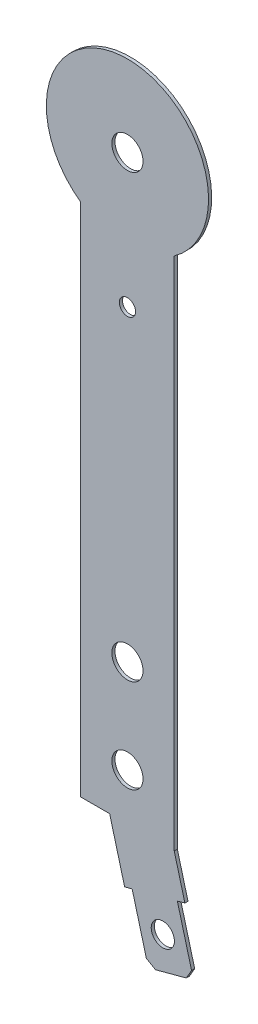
ISO-10303-21;
HEADER;
FILE_DESCRIPTION(('STEP AP214'),'2;1');
FILE_NAME('part.step','',(''),(''),'','','');
FILE_SCHEMA(('AUTOMOTIVE_DESIGN { 1 0 10303 214 1 1 1 1 }'));
ENDSEC;
DATA;
#1=APPLICATION_CONTEXT('core data for automotive mechanical design processes');
#2=APPLICATION_PROTOCOL_DEFINITION('international standard','automotive_design',2000,#1);
#3=PRODUCT_CONTEXT('',#1,'mechanical');
#4=PRODUCT('Part','Part','',(#3));
#5=PRODUCT_RELATED_PRODUCT_CATEGORY('part','',(#4));
#6=PRODUCT_DEFINITION_FORMATION('','',#4);
#7=PRODUCT_DEFINITION_CONTEXT('part definition',#1,'design');
#8=PRODUCT_DEFINITION('design','',#6,#7);
#9=PRODUCT_DEFINITION_SHAPE('','',#8);
#10=(LENGTH_UNIT() NAMED_UNIT(*) SI_UNIT(.MILLI.,.METRE.));
#11=(NAMED_UNIT(*) PLANE_ANGLE_UNIT() SI_UNIT($,.RADIAN.));
#12=(NAMED_UNIT(*) SI_UNIT($,.STERADIAN.) SOLID_ANGLE_UNIT());
#13=UNCERTAINTY_MEASURE_WITH_UNIT(LENGTH_MEASURE(1.E-05),#10,'distance_accuracy_value','');
#14=(GEOMETRIC_REPRESENTATION_CONTEXT(3) GLOBAL_UNCERTAINTY_ASSIGNED_CONTEXT((#13)) GLOBAL_UNIT_ASSIGNED_CONTEXT((#10,
#11,#12)) REPRESENTATION_CONTEXT('',''));
#15=CARTESIAN_POINT('',(0.,0.,0.));
#16=DIRECTION('',(0.,0.,1.));
#17=DIRECTION('',(1.,0.,0.));
#18=AXIS2_PLACEMENT_3D('',#15,#16,#17);
#19=CARTESIAN_POINT('',(0.,59.1936714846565,0.3175));
#20=DIRECTION('',(0.,0.,-1.));
#21=DIRECTION('',(-1.,0.,0.));
#22=AXIS2_PLACEMENT_3D('',#19,#20,#21);
#23=CYLINDRICAL_SURFACE('',#22,8.255);
#24=CARTESIAN_POINT('',(0.,59.1936714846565,0.));
#25=DIRECTION('',(0.,0.,1.));
#26=DIRECTION('',(1.,0.,0.));
#27=AXIS2_PLACEMENT_3D('',#24,#25,#26);
#28=CIRCLE('',#27,8.255);
#29=CARTESIAN_POINT('',(4.7625,52.451,0.));
#30=VERTEX_POINT('',#29);
#31=CARTESIAN_POINT('',(-4.7625,52.451,0.));
#32=VERTEX_POINT('',#31);
#33=EDGE_CURVE('E197',#30,#32,#28,.T.);
#34=ORIENTED_EDGE('',*,*,#33,.T.);
#35=DIRECTION('',(0.,0.,-1.));
#36=VECTOR('',#35,1.);
#37=CARTESIAN_POINT('',(-4.7625,52.451,0.3175));
#38=LINE('',#37,#36);
#39=CARTESIAN_POINT('',(-4.7625,52.451,0.3175));
#40=VERTEX_POINT('',#39);
#41=EDGE_CURVE('E220',#40,#32,#38,.T.);
#42=ORIENTED_EDGE('',*,*,#41,.F.);
#43=CARTESIAN_POINT('',(0.,59.1936714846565,0.3175));
#44=DIRECTION('',(0.,0.,1.));
#45=DIRECTION('',(1.,0.,0.));
#46=AXIS2_PLACEMENT_3D('',#43,#44,#45);
#47=CIRCLE('',#46,8.255);
#48=CARTESIAN_POINT('',(4.7625,52.451,0.3175));
#49=VERTEX_POINT('',#48);
#50=EDGE_CURVE('E200',#49,#40,#47,.T.);
#51=ORIENTED_EDGE('',*,*,#50,.F.);
#52=DIRECTION('',(0.,0.,-1.));
#53=VECTOR('',#52,1.);
#54=CARTESIAN_POINT('',(4.7625,52.451,0.3175));
#55=LINE('',#54,#53);
#56=EDGE_CURVE('E209',#49,#30,#55,.T.);
#57=ORIENTED_EDGE('',*,*,#56,.T.);
#58=EDGE_LOOP('',(#34,#42,#51,#57));
#59=FACE_BOUND('',#58,.T.);
#60=ADVANCED_FACE('F35',(#59),#23,.T.);
#61=CARTESIAN_POINT('',(-4.7625,52.451,0.3175));
#62=DIRECTION('',(1.,0.,0.));
#63=DIRECTION('',(0.,1.,0.));
#64=AXIS2_PLACEMENT_3D('',#61,#62,#63);
#65=PLANE('',#64);
#66=DIRECTION('',(0.,-1.,0.));
#67=VECTOR('',#66,1.);
#68=CARTESIAN_POINT('',(-4.7625,52.451,0.));
#69=LINE('',#68,#67);
#70=CARTESIAN_POINT('',(-4.76250000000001,0.,0.));
#71=VERTEX_POINT('',#70);
#72=EDGE_CURVE('E212',#32,#71,#69,.T.);
#73=ORIENTED_EDGE('',*,*,#72,.T.);
#74=DIRECTION('',(0.,0.,-1.));
#75=VECTOR('',#74,1.);
#76=CARTESIAN_POINT('',(-4.76250000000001,0.,0.3175));
#77=LINE('',#76,#75);
#78=CARTESIAN_POINT('',(-4.76250000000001,0.,0.3175));
#79=VERTEX_POINT('',#78);
#80=EDGE_CURVE('E224',#79,#71,#77,.T.);
#81=ORIENTED_EDGE('',*,*,#80,.F.);
#82=DIRECTION('',(0.,-1.,0.));
#83=VECTOR('',#82,1.);
#84=CARTESIAN_POINT('',(-4.7625,52.451,0.3175));
#85=LINE('',#84,#83);
#86=EDGE_CURVE('E203',#40,#79,#85,.T.);
#87=ORIENTED_EDGE('',*,*,#86,.F.);
#88=ORIENTED_EDGE('',*,*,#41,.T.);
#89=EDGE_LOOP('',(#73,#81,#87,#88));
#90=FACE_BOUND('',#89,.T.);
#91=ADVANCED_FACE('F243',(#90),#65,.F.);
#92=CARTESIAN_POINT('',(-4.76250000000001,0.,0.3175));
#93=DIRECTION('',(0.,1.,0.));
#94=DIRECTION('',(0.,0.,1.));
#95=AXIS2_PLACEMENT_3D('',#92,#93,#94);
#96=PLANE('',#95);
#97=DIRECTION('',(1.,0.,0.));
#98=VECTOR('',#97,1.);
#99=CARTESIAN_POINT('',(-4.76250000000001,0.,0.));
#100=LINE('',#99,#98);
#101=CARTESIAN_POINT('',(-1.81150374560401,0.,0.));
#102=VERTEX_POINT('',#101);
#103=EDGE_CURVE('E214',#71,#102,#100,.T.);
#104=ORIENTED_EDGE('',*,*,#103,.T.);
#105=DIRECTION('',(0.,0.,1.));
#106=VECTOR('',#105,1.);
#107=CARTESIAN_POINT('',(-1.81150374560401,0.,-14.4179313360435));
#108=LINE('',#107,#106);
#109=CARTESIAN_POINT('',(-1.81150374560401,0.,0.3175));
#110=VERTEX_POINT('',#109);
#111=EDGE_CURVE('E144',#102,#110,#108,.T.);
#112=ORIENTED_EDGE('',*,*,#111,.T.);
#113=DIRECTION('',(1.,0.,0.));
#114=VECTOR('',#113,1.);
#115=CARTESIAN_POINT('',(-4.76250000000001,0.,0.3175));
#116=LINE('',#115,#114);
#117=EDGE_CURVE('E158',#79,#110,#116,.T.);
#118=ORIENTED_EDGE('',*,*,#117,.F.);
#119=ORIENTED_EDGE('',*,*,#80,.T.);
#120=EDGE_LOOP('',(#104,#112,#118,#119));
#121=FACE_BOUND('',#120,.T.);
#122=ADVANCED_FACE('F345',(#121),#96,.F.);
#123=CARTESIAN_POINT('',(4.7625,52.451,0.3175));
#124=DIRECTION('',(-1.,0.,0.));
#125=DIRECTION('',(0.,-1.,0.));
#126=AXIS2_PLACEMENT_3D('',#123,#124,#125);
#127=PLANE('',#126);
#128=DIRECTION('',(0.,1.,0.));
#129=VECTOR('',#128,1.);
#130=CARTESIAN_POINT('',(4.7625,52.451,0.));
#131=LINE('',#130,#129);
#132=CARTESIAN_POINT('',(4.76250000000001,0.,0.));
#133=VERTEX_POINT('',#132);
#134=EDGE_CURVE('E204',#133,#30,#131,.T.);
#135=ORIENTED_EDGE('',*,*,#134,.T.);
#136=ORIENTED_EDGE('',*,*,#56,.F.);
#137=DIRECTION('',(0.,1.,0.));
#138=VECTOR('',#137,1.);
#139=CARTESIAN_POINT('',(4.7625,52.451,0.3175));
#140=LINE('',#139,#138);
#141=CARTESIAN_POINT('',(4.76250000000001,0.,0.3175));
#142=VERTEX_POINT('',#141);
#143=EDGE_CURVE('E207',#142,#49,#140,.T.);
#144=ORIENTED_EDGE('',*,*,#143,.F.);
#145=DIRECTION('',(0.,0.,-1.));
#146=VECTOR('',#145,1.);
#147=CARTESIAN_POINT('',(4.76250000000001,0.,0.3175));
#148=LINE('',#147,#146);
#149=EDGE_CURVE('E227',#142,#133,#148,.T.);
#150=ORIENTED_EDGE('',*,*,#149,.T.);
#151=EDGE_LOOP('',(#135,#136,#144,#150));
#152=FACE_BOUND('',#151,.T.);
#153=ADVANCED_FACE('F247',(#152),#127,.F.);
#154=CARTESIAN_POINT('',(0.,59.1936714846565,0.3175));
#155=DIRECTION('',(0.,0.,1.));
#156=DIRECTION('',(1.,0.,0.));
#157=AXIS2_PLACEMENT_3D('',#154,#155,#156);
#158=PLANE('',#157);
#159=CARTESIAN_POINT('',(3.60214658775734,-7.93676010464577,0.3175));
#160=DIRECTION('',(0.,0.,1.));
#161=DIRECTION('',(1.,0.,0.));
#162=AXIS2_PLACEMENT_3D('',#159,#160,#161);
#163=CIRCLE('',#162,1.1811);
#164=CARTESIAN_POINT('',(4.78324658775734,-7.93676010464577,0.3175));
#165=VERTEX_POINT('',#164);
#166=EDGE_CURVE('E161',#165,#165,#163,.T.);
#167=ORIENTED_EDGE('',*,*,#166,.F.);
#168=EDGE_LOOP('',(#167));
#169=FACE_BOUND('',#168,.T.);
#170=CARTESIAN_POINT('',(0.,45.5676,0.3175));
#171=DIRECTION('',(0.,0.,1.));
#172=DIRECTION('',(1.,0.,0.));
#173=AXIS2_PLACEMENT_3D('',#170,#171,#172);
#174=CIRCLE('',#173,0.825499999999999);
#175=CARTESIAN_POINT('',(0.825499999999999,45.5676,0.3175));
#176=VERTEX_POINT('',#175);
#177=EDGE_CURVE('E179',#176,#176,#174,.T.);
#178=ORIENTED_EDGE('',*,*,#177,.F.);
#179=EDGE_LOOP('',(#178));
#180=FACE_BOUND('',#179,.T.);
#181=CARTESIAN_POINT('',(0.,14.2875,0.3175));
#182=DIRECTION('',(0.,0.,1.));
#183=DIRECTION('',(1.,0.,0.));
#184=AXIS2_PLACEMENT_3D('',#181,#182,#183);
#185=CIRCLE('',#184,1.5875);
#186=CARTESIAN_POINT('',(1.5875,14.2875,0.3175));
#187=VERTEX_POINT('',#186);
#188=EDGE_CURVE('E178',#187,#187,#185,.T.);
#189=ORIENTED_EDGE('',*,*,#188,.F.);
#190=EDGE_LOOP('',(#189));
#191=FACE_BOUND('',#190,.T.);
#192=CARTESIAN_POINT('',(0.,4.7625,0.3175));
#193=DIRECTION('',(0.,0.,1.));
#194=DIRECTION('',(1.,0.,0.));
#195=AXIS2_PLACEMENT_3D('',#192,#193,#194);
#196=CIRCLE('',#195,1.5875);
#197=CARTESIAN_POINT('',(1.5875,4.7625,0.3175));
#198=VERTEX_POINT('',#197);
#199=EDGE_CURVE('E185',#198,#198,#196,.T.);
#200=ORIENTED_EDGE('',*,*,#199,.F.);
#201=EDGE_LOOP('',(#200));
#202=FACE_BOUND('',#201,.T.);
#203=CARTESIAN_POINT('',(0.,59.1936714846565,0.3175));
#204=DIRECTION('',(0.,0.,1.));
#205=DIRECTION('',(1.,0.,0.));
#206=AXIS2_PLACEMENT_3D('',#203,#204,#205);
#207=CIRCLE('',#206,1.5875);
#208=CARTESIAN_POINT('',(1.5875,59.1936714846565,0.3175));
#209=VERTEX_POINT('',#208);
#210=EDGE_CURVE('E191',#209,#209,#207,.T.);
#211=ORIENTED_EDGE('',*,*,#210,.F.);
#212=EDGE_LOOP('',(#211));
#213=FACE_BOUND('',#212,.T.);
#214=DIRECTION('',(0.258819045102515,-0.96592582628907,0.));
#215=VECTOR('',#214,1.);
#216=CARTESIAN_POINT('',(2.12378618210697,-11.6198874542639,0.3175));
#217=LINE('',#216,#215);
#218=CARTESIAN_POINT('',(0.480285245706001,-5.48625845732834,0.3175));
#219=VERTEX_POINT('',#218);
#220=CARTESIAN_POINT('',(1.92656606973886,-10.8838519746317,0.3175));
#221=VERTEX_POINT('',#220);
#222=EDGE_CURVE('E153',#219,#221,#217,.T.);
#223=ORIENTED_EDGE('',*,*,#222,.T.);
#224=DIRECTION('',(-0.866025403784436,0.500000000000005,0.));
#225=VECTOR('',#224,1.);
#226=CARTESIAN_POINT('',(-29.8628162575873,7.46975646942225,0.3175));
#227=LINE('',#226,#225);
#228=CARTESIAN_POINT('',(2.85982166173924,-11.4226673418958,0.3175));
#229=VERTEX_POINT('',#228);
#230=EDGE_CURVE('E282',#221,#229,#227,.F.);
#231=ORIENTED_EDGE('',*,*,#230,.T.);
#232=DIRECTION('',(0.96592582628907,0.258819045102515,0.));
#233=VECTOR('',#232,1.);
#234=CARTESIAN_POINT('',(2.12378618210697,-11.6198874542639,0.3175));
#235=LINE('',#234,#233);
#236=CARTESIAN_POINT('',(5.9879724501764,-10.5844818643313,0.3175));
#237=VERTEX_POINT('',#236);
#238=EDGE_CURVE('E261',#229,#237,#235,.T.);
#239=ORIENTED_EDGE('',*,*,#238,.T.);
#240=DIRECTION('',(-0.500000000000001,-0.866025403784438,0.));
#241=VECTOR('',#240,1.);
#242=CARTESIAN_POINT('',(34.7058060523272,39.1562650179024,0.3175));
#243=LINE('',#242,#241);
#244=CARTESIAN_POINT('',(6.52678781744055,-9.65122627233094,0.3175));
#245=VERTEX_POINT('',#244);
#246=EDGE_CURVE('E278',#237,#245,#243,.F.);
#247=ORIENTED_EDGE('',*,*,#246,.T.);
#248=DIRECTION('',(-0.258819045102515,0.96592582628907,0.));
#249=VECTOR('',#248,1.);
#250=CARTESIAN_POINT('',(6.72400792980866,-10.3872617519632,0.3175));
#251=LINE('',#250,#249);
#252=CARTESIAN_POINT('',(5.0805069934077,-4.25363275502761,0.3175));
#253=VERTEX_POINT('',#252);
#254=EDGE_CURVE('E264',#245,#253,#251,.T.);
#255=ORIENTED_EDGE('',*,*,#254,.T.);
#256=DIRECTION('',(0.965925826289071,0.258819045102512,0.));
#257=VECTOR('',#256,1.);
#258=CARTESIAN_POINT('',(5.0805069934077,-4.25363275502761,0.3175));
#259=LINE('',#258,#257);
#260=CARTESIAN_POINT('',(5.84721061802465,-4.04819513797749,0.3175));
#261=VERTEX_POINT('',#260);
#262=EDGE_CURVE('E266',#253,#261,#259,.T.);
#263=ORIENTED_EDGE('',*,*,#262,.T.);
#264=DIRECTION('',(-0.258819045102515,0.96592582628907,0.));
#265=VECTOR('',#264,1.);
#266=CARTESIAN_POINT('',(4.76250000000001,0.,0.3175));
#267=LINE('',#266,#265);
#268=EDGE_CURVE('E170',#261,#142,#267,.T.);
#269=ORIENTED_EDGE('',*,*,#268,.T.);
#270=ORIENTED_EDGE('',*,*,#143,.T.);
#271=ORIENTED_EDGE('',*,*,#50,.T.);
#272=ORIENTED_EDGE('',*,*,#86,.T.);
#273=ORIENTED_EDGE('',*,*,#117,.T.);
#274=DIRECTION('',(0.258819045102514,-0.96592582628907,0.));
#275=VECTOR('',#274,1.);
#276=CARTESIAN_POINT('',(-1.81150374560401,0.,0.3175));
#277=LINE('',#276,#275);
#278=CARTESIAN_POINT('',(-0.286418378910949,-5.69169607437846,0.3175));
#279=VERTEX_POINT('',#278);
#280=EDGE_CURVE('E138',#110,#279,#277,.T.);
#281=ORIENTED_EDGE('',*,*,#280,.T.);
#282=DIRECTION('',(0.96592582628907,0.258819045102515,0.));
#283=VECTOR('',#282,1.);
#284=CARTESIAN_POINT('',(-0.286418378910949,-5.69169607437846,0.3175));
#285=LINE('',#284,#283);
#286=EDGE_CURVE('E147',#279,#219,#285,.T.);
#287=ORIENTED_EDGE('',*,*,#286,.T.);
#288=EDGE_LOOP('',(#223,#231,#239,#247,#255,#263,#269,#270,#271,#272,#273,#281,#287));
#289=FACE_BOUND('',#288,.T.);
#290=ADVANCED_FACE('F156',(#169,#180,#191,#202,#213,#289),#158,.T.);
#291=CARTESIAN_POINT('',(0.,59.1936714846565,0.));
#292=DIRECTION('',(0.,0.,1.));
#293=DIRECTION('',(1.,0.,0.));
#294=AXIS2_PLACEMENT_3D('',#291,#292,#293);
#295=PLANE('',#294);
#296=CARTESIAN_POINT('',(3.60214658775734,-7.93676010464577,0.));
#297=DIRECTION('',(0.,0.,1.));
#298=DIRECTION('',(1.,0.,0.));
#299=AXIS2_PLACEMENT_3D('',#296,#297,#298);
#300=CIRCLE('',#299,1.1811);
#301=CARTESIAN_POINT('',(4.78324658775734,-7.93676010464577,0.));
#302=VERTEX_POINT('',#301);
#303=EDGE_CURVE('E39',#302,#302,#300,.T.);
#304=ORIENTED_EDGE('',*,*,#303,.T.);
#305=EDGE_LOOP('',(#304));
#306=FACE_BOUND('',#305,.T.);
#307=CARTESIAN_POINT('',(0.,45.5676,0.));
#308=DIRECTION('',(0.,0.,1.));
#309=DIRECTION('',(1.,0.,0.));
#310=AXIS2_PLACEMENT_3D('',#307,#308,#309);
#311=CIRCLE('',#310,0.825499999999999);
#312=CARTESIAN_POINT('',(0.825499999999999,45.5676,0.));
#313=VERTEX_POINT('',#312);
#314=EDGE_CURVE('E175',#313,#313,#311,.T.);
#315=ORIENTED_EDGE('',*,*,#314,.T.);
#316=EDGE_LOOP('',(#315));
#317=FACE_BOUND('',#316,.T.);
#318=CARTESIAN_POINT('',(0.,14.2875,0.));
#319=DIRECTION('',(0.,0.,1.));
#320=DIRECTION('',(1.,0.,0.));
#321=AXIS2_PLACEMENT_3D('',#318,#319,#320);
#322=CIRCLE('',#321,1.5875);
#323=CARTESIAN_POINT('',(1.5875,14.2875,0.));
#324=VERTEX_POINT('',#323);
#325=EDGE_CURVE('E182',#324,#324,#322,.T.);
#326=ORIENTED_EDGE('',*,*,#325,.T.);
#327=EDGE_LOOP('',(#326));
#328=FACE_BOUND('',#327,.T.);
#329=CARTESIAN_POINT('',(0.,4.7625,0.));
#330=DIRECTION('',(0.,0.,1.));
#331=DIRECTION('',(1.,0.,0.));
#332=AXIS2_PLACEMENT_3D('',#329,#330,#331);
#333=CIRCLE('',#332,1.5875);
#334=CARTESIAN_POINT('',(1.5875,4.7625,0.));
#335=VERTEX_POINT('',#334);
#336=EDGE_CURVE('E188',#335,#335,#333,.T.);
#337=ORIENTED_EDGE('',*,*,#336,.T.);
#338=EDGE_LOOP('',(#337));
#339=FACE_BOUND('',#338,.T.);
#340=CARTESIAN_POINT('',(0.,59.1936714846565,0.));
#341=DIRECTION('',(0.,0.,1.));
#342=DIRECTION('',(1.,0.,0.));
#343=AXIS2_PLACEMENT_3D('',#340,#341,#342);
#344=CIRCLE('',#343,1.5875);
#345=CARTESIAN_POINT('',(1.5875,59.1936714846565,0.));
#346=VERTEX_POINT('',#345);
#347=EDGE_CURVE('E194',#346,#346,#344,.T.);
#348=ORIENTED_EDGE('',*,*,#347,.T.);
#349=EDGE_LOOP('',(#348));
#350=FACE_BOUND('',#349,.T.);
#351=DIRECTION('',(-0.96592582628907,-0.258819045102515,0.));
#352=VECTOR('',#351,1.);
#353=CARTESIAN_POINT('',(2.12378618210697,-11.6198874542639,0.));
#354=LINE('',#353,#352);
#355=CARTESIAN_POINT('',(5.98797245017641,-10.5844818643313,0.));
#356=VERTEX_POINT('',#355);
#357=CARTESIAN_POINT('',(2.85982166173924,-11.4226673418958,0.));
#358=VERTEX_POINT('',#357);
#359=EDGE_CURVE('E296',#356,#358,#354,.T.);
#360=ORIENTED_EDGE('',*,*,#359,.T.);
#361=DIRECTION('',(0.866025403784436,-0.500000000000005,0.));
#362=VECTOR('',#361,1.);
#363=CARTESIAN_POINT('',(1.92656606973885,-10.8838519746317,0.));
#364=LINE('',#363,#362);
#365=CARTESIAN_POINT('',(1.92656606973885,-10.8838519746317,0.));
#366=VERTEX_POINT('',#365);
#367=EDGE_CURVE('E44',#358,#366,#364,.F.);
#368=ORIENTED_EDGE('',*,*,#367,.T.);
#369=DIRECTION('',(-0.258819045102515,0.96592582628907,0.));
#370=VECTOR('',#369,1.);
#371=CARTESIAN_POINT('',(2.12378618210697,-11.6198874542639,0.));
#372=LINE('',#371,#370);
#373=CARTESIAN_POINT('',(0.480285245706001,-5.48625845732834,0.));
#374=VERTEX_POINT('',#373);
#375=EDGE_CURVE('E295',#366,#374,#372,.T.);
#376=ORIENTED_EDGE('',*,*,#375,.T.);
#377=DIRECTION('',(-0.96592582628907,-0.258819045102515,0.));
#378=VECTOR('',#377,1.);
#379=CARTESIAN_POINT('',(-0.286418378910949,-5.69169607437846,0.));
#380=LINE('',#379,#378);
#381=CARTESIAN_POINT('',(-0.286418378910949,-5.69169607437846,0.));
#382=VERTEX_POINT('',#381);
#383=EDGE_CURVE('E270',#374,#382,#380,.T.);
#384=ORIENTED_EDGE('',*,*,#383,.T.);
#385=DIRECTION('',(-0.258819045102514,0.96592582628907,0.));
#386=VECTOR('',#385,1.);
#387=CARTESIAN_POINT('',(-1.81150374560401,0.,0.));
#388=LINE('',#387,#386);
#389=EDGE_CURVE('E140',#382,#102,#388,.T.);
#390=ORIENTED_EDGE('',*,*,#389,.T.);
#391=ORIENTED_EDGE('',*,*,#103,.F.);
#392=ORIENTED_EDGE('',*,*,#72,.F.);
#393=ORIENTED_EDGE('',*,*,#33,.F.);
#394=ORIENTED_EDGE('',*,*,#134,.F.);
#395=DIRECTION('',(0.258819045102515,-0.96592582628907,0.));
#396=VECTOR('',#395,1.);
#397=CARTESIAN_POINT('',(4.76250000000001,0.,0.));
#398=LINE('',#397,#396);
#399=CARTESIAN_POINT('',(5.84721061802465,-4.04819513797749,0.));
#400=VERTEX_POINT('',#399);
#401=EDGE_CURVE('E251',#133,#400,#398,.T.);
#402=ORIENTED_EDGE('',*,*,#401,.T.);
#403=DIRECTION('',(-0.965925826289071,-0.258819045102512,0.));
#404=VECTOR('',#403,1.);
#405=CARTESIAN_POINT('',(5.0805069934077,-4.25363275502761,0.));
#406=LINE('',#405,#404);
#407=CARTESIAN_POINT('',(5.0805069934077,-4.25363275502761,0.));
#408=VERTEX_POINT('',#407);
#409=EDGE_CURVE('E254',#400,#408,#406,.T.);
#410=ORIENTED_EDGE('',*,*,#409,.T.);
#411=DIRECTION('',(0.258819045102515,-0.96592582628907,0.));
#412=VECTOR('',#411,1.);
#413=CARTESIAN_POINT('',(6.72400792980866,-10.3872617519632,0.));
#414=LINE('',#413,#412);
#415=CARTESIAN_POINT('',(6.52678781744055,-9.65122627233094,0.));
#416=VERTEX_POINT('',#415);
#417=EDGE_CURVE('E256',#408,#416,#414,.T.);
#418=ORIENTED_EDGE('',*,*,#417,.T.);
#419=DIRECTION('',(0.500000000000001,0.866025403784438,0.));
#420=VECTOR('',#419,1.);
#421=CARTESIAN_POINT('',(5.98797245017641,-10.5844818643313,0.));
#422=LINE('',#421,#420);
#423=EDGE_CURVE('E291',#416,#356,#422,.F.);
#424=ORIENTED_EDGE('',*,*,#423,.T.);
#425=EDGE_LOOP('',(#360,#368,#376,#384,#390,#391,#392,#393,#394,#402,#410,#418,#424));
#426=FACE_BOUND('',#425,.T.);
#427=ADVANCED_FACE('F239',(#306,#317,#328,#339,#350,#426),#295,.F.);
#428=CARTESIAN_POINT('',(0.,59.1936714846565,0.));
#429=DIRECTION('',(0.,0.,1.));
#430=DIRECTION('',(1.,0.,0.));
#431=AXIS2_PLACEMENT_3D('',#428,#429,#430);
#432=CYLINDRICAL_SURFACE('',#431,1.5875);
#433=ORIENTED_EDGE('',*,*,#347,.F.);
#434=EDGE_LOOP('',(#433));
#435=FACE_BOUND('',#434,.T.);
#436=ORIENTED_EDGE('',*,*,#210,.T.);
#437=EDGE_LOOP('',(#436));
#438=FACE_BOUND('',#437,.T.);
#439=ADVANCED_FACE('F325',(#435,#438),#432,.F.);
#440=CARTESIAN_POINT('',(0.,4.7625,0.));
#441=DIRECTION('',(0.,0.,1.));
#442=DIRECTION('',(1.,0.,0.));
#443=AXIS2_PLACEMENT_3D('',#440,#441,#442);
#444=CYLINDRICAL_SURFACE('',#443,1.5875);
#445=ORIENTED_EDGE('',*,*,#336,.F.);
#446=EDGE_LOOP('',(#445));
#447=FACE_BOUND('',#446,.T.);
#448=ORIENTED_EDGE('',*,*,#199,.T.);
#449=EDGE_LOOP('',(#448));
#450=FACE_BOUND('',#449,.T.);
#451=ADVANCED_FACE('F327',(#447,#450),#444,.F.);
#452=CARTESIAN_POINT('',(0.,14.2875,0.));
#453=DIRECTION('',(0.,0.,1.));
#454=DIRECTION('',(1.,0.,0.));
#455=AXIS2_PLACEMENT_3D('',#452,#453,#454);
#456=CYLINDRICAL_SURFACE('',#455,1.5875);
#457=ORIENTED_EDGE('',*,*,#325,.F.);
#458=EDGE_LOOP('',(#457));
#459=FACE_BOUND('',#458,.T.);
#460=ORIENTED_EDGE('',*,*,#188,.T.);
#461=EDGE_LOOP('',(#460));
#462=FACE_BOUND('',#461,.T.);
#463=ADVANCED_FACE('F334',(#459,#462),#456,.F.);
#464=CARTESIAN_POINT('',(0.,45.5676,0.));
#465=DIRECTION('',(0.,0.,1.));
#466=DIRECTION('',(1.,0.,0.));
#467=AXIS2_PLACEMENT_3D('',#464,#465,#466);
#468=CYLINDRICAL_SURFACE('',#467,0.825499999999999);
#469=ORIENTED_EDGE('',*,*,#314,.F.);
#470=EDGE_LOOP('',(#469));
#471=FACE_BOUND('',#470,.T.);
#472=ORIENTED_EDGE('',*,*,#177,.T.);
#473=EDGE_LOOP('',(#472));
#474=FACE_BOUND('',#473,.T.);
#475=ADVANCED_FACE('F360',(#471,#474),#468,.F.);
#476=CARTESIAN_POINT('',(4.76250000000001,0.,-14.4179313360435));
#477=DIRECTION('',(0.96592582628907,0.258819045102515,0.));
#478=DIRECTION('',(-0.258819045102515,0.96592582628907,0.));
#479=AXIS2_PLACEMENT_3D('',#476,#477,#478);
#480=PLANE('',#479);
#481=ORIENTED_EDGE('',*,*,#401,.F.);
#482=ORIENTED_EDGE('',*,*,#149,.F.);
#483=ORIENTED_EDGE('',*,*,#268,.F.);
#484=DIRECTION('',(0.,0.,1.));
#485=VECTOR('',#484,1.);
#486=CARTESIAN_POINT('',(5.84721061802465,-4.04819513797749,-14.4179313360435));
#487=LINE('',#486,#485);
#488=EDGE_CURVE('E252',#400,#261,#487,.T.);
#489=ORIENTED_EDGE('',*,*,#488,.F.);
#490=EDGE_LOOP('',(#481,#482,#483,#489));
#491=FACE_BOUND('',#490,.T.);
#492=ADVANCED_FACE('F249',(#491),#480,.T.);
#493=CARTESIAN_POINT('',(5.0805069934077,-4.25363275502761,-14.4179313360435));
#494=DIRECTION('',(0.258819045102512,-0.965925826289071,0.));
#495=DIRECTION('',(0.965925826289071,0.258819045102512,0.));
#496=AXIS2_PLACEMENT_3D('',#493,#494,#495);
#497=PLANE('',#496);
#498=ORIENTED_EDGE('',*,*,#409,.F.);
#499=ORIENTED_EDGE('',*,*,#488,.T.);
#500=ORIENTED_EDGE('',*,*,#262,.F.);
#501=DIRECTION('',(0.,0.,1.));
#502=VECTOR('',#501,1.);
#503=CARTESIAN_POINT('',(5.0805069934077,-4.25363275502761,-14.4179313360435));
#504=LINE('',#503,#502);
#505=EDGE_CURVE('E271',#408,#253,#504,.T.);
#506=ORIENTED_EDGE('',*,*,#505,.F.);
#507=EDGE_LOOP('',(#498,#499,#500,#506));
#508=FACE_BOUND('',#507,.T.);
#509=ADVANCED_FACE('F277',(#508),#497,.T.);
#510=CARTESIAN_POINT('',(6.72400792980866,-10.3872617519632,-14.4179313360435));
#511=DIRECTION('',(0.96592582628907,0.258819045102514,0.));
#512=DIRECTION('',(-0.258819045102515,0.96592582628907,0.));
#513=AXIS2_PLACEMENT_3D('',#510,#511,#512);
#514=PLANE('',#513);
#515=ORIENTED_EDGE('',*,*,#254,.F.);
#516=DIRECTION('',(0.,0.,-1.));
#517=VECTOR('',#516,1.);
#518=CARTESIAN_POINT('',(6.52678781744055,-9.65122627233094,-14.4179313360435));
#519=LINE('',#518,#517);
#520=EDGE_CURVE('E11',#245,#416,#519,.T.);
#521=ORIENTED_EDGE('',*,*,#520,.T.);
#522=ORIENTED_EDGE('',*,*,#417,.F.);
#523=ORIENTED_EDGE('',*,*,#505,.T.);
#524=EDGE_LOOP('',(#515,#521,#522,#523));
#525=FACE_BOUND('',#524,.T.);
#526=ADVANCED_FACE('F275',(#525),#514,.T.);
#527=CARTESIAN_POINT('',(2.12378618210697,-11.6198874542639,-14.4179313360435));
#528=DIRECTION('',(0.258819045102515,-0.96592582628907,0.));
#529=DIRECTION('',(0.96592582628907,0.258819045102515,0.));
#530=AXIS2_PLACEMENT_3D('',#527,#528,#529);
#531=PLANE('',#530);
#532=ORIENTED_EDGE('',*,*,#238,.F.);
#533=DIRECTION('',(0.,0.,-1.));
#534=VECTOR('',#533,1.);
#535=CARTESIAN_POINT('',(2.85982166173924,-11.4226673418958,-14.4179313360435));
#536=LINE('',#535,#534);
#537=EDGE_CURVE('E57',#229,#358,#536,.T.);
#538=ORIENTED_EDGE('',*,*,#537,.T.);
#539=ORIENTED_EDGE('',*,*,#359,.F.);
#540=DIRECTION('',(0.,0.,1.));
#541=VECTOR('',#540,1.);
#542=CARTESIAN_POINT('',(5.98797245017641,-10.5844818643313,-14.4179313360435));
#543=LINE('',#542,#541);
#544=EDGE_CURVE('E284',#356,#237,#543,.T.);
#545=ORIENTED_EDGE('',*,*,#544,.T.);
#546=EDGE_LOOP('',(#532,#538,#539,#545));
#547=FACE_BOUND('',#546,.T.);
#548=ADVANCED_FACE('F303',(#547),#531,.T.);
#549=CARTESIAN_POINT('',(2.12378618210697,-11.6198874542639,-14.4179313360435));
#550=DIRECTION('',(-0.96592582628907,-0.258819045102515,0.));
#551=DIRECTION('',(0.258819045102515,-0.96592582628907,0.));
#552=AXIS2_PLACEMENT_3D('',#549,#550,#551);
#553=PLANE('',#552);
#554=ORIENTED_EDGE('',*,*,#375,.F.);
#555=DIRECTION('',(0.,0.,1.));
#556=VECTOR('',#555,1.);
#557=CARTESIAN_POINT('',(1.92656606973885,-10.8838519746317,-14.4179313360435));
#558=LINE('',#557,#556);
#559=EDGE_CURVE('E223',#366,#221,#558,.T.);
#560=ORIENTED_EDGE('',*,*,#559,.T.);
#561=ORIENTED_EDGE('',*,*,#222,.F.);
#562=DIRECTION('',(0.,0.,1.));
#563=VECTOR('',#562,1.);
#564=CARTESIAN_POINT('',(0.480285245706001,-5.48625845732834,-14.4179313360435));
#565=LINE('',#564,#563);
#566=EDGE_CURVE('E143',#374,#219,#565,.T.);
#567=ORIENTED_EDGE('',*,*,#566,.F.);
#568=EDGE_LOOP('',(#554,#560,#561,#567));
#569=FACE_BOUND('',#568,.T.);
#570=ADVANCED_FACE('F300',(#569),#553,.T.);
#571=CARTESIAN_POINT('',(-0.286418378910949,-5.69169607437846,-14.4179313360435));
#572=DIRECTION('',(0.258819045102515,-0.96592582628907,0.));
#573=DIRECTION('',(0.96592582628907,0.258819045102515,0.));
#574=AXIS2_PLACEMENT_3D('',#571,#572,#573);
#575=PLANE('',#574);
#576=ORIENTED_EDGE('',*,*,#383,.F.);
#577=ORIENTED_EDGE('',*,*,#566,.T.);
#578=ORIENTED_EDGE('',*,*,#286,.F.);
#579=DIRECTION('',(0.,0.,1.));
#580=VECTOR('',#579,1.);
#581=CARTESIAN_POINT('',(-0.286418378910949,-5.69169607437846,-14.4179313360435));
#582=LINE('',#581,#580);
#583=EDGE_CURVE('E133',#382,#279,#582,.T.);
#584=ORIENTED_EDGE('',*,*,#583,.F.);
#585=EDGE_LOOP('',(#576,#577,#578,#584));
#586=FACE_BOUND('',#585,.T.);
#587=ADVANCED_FACE('F148',(#586),#575,.T.);
#588=CARTESIAN_POINT('',(-1.81150374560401,0.,-14.4179313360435));
#589=DIRECTION('',(-0.96592582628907,-0.258819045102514,0.));
#590=DIRECTION('',(0.258819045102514,-0.96592582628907,0.));
#591=AXIS2_PLACEMENT_3D('',#588,#589,#590);
#592=PLANE('',#591);
#593=ORIENTED_EDGE('',*,*,#389,.F.);
#594=ORIENTED_EDGE('',*,*,#583,.T.);
#595=ORIENTED_EDGE('',*,*,#280,.F.);
#596=ORIENTED_EDGE('',*,*,#111,.F.);
#597=EDGE_LOOP('',(#593,#594,#595,#596));
#598=FACE_BOUND('',#597,.T.);
#599=ADVANCED_FACE('F135',(#598),#592,.T.);
#600=CARTESIAN_POINT('',(1.92656606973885,-10.8838519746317,-14.4179313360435));
#601=DIRECTION('',(0.500000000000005,0.866025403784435,0.));
#602=DIRECTION('',(0.,0.,1.));
#603=AXIS2_PLACEMENT_3D('',#600,#601,#602);
#604=PLANE('',#603);
#605=ORIENTED_EDGE('',*,*,#367,.F.);
#606=ORIENTED_EDGE('',*,*,#537,.F.);
#607=ORIENTED_EDGE('',*,*,#230,.F.);
#608=ORIENTED_EDGE('',*,*,#559,.F.);
#609=EDGE_LOOP('',(#605,#606,#607,#608));
#610=FACE_BOUND('',#609,.T.);
#611=ADVANCED_FACE('F302',(#610),#604,.F.);
#612=CARTESIAN_POINT('',(5.98797245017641,-10.5844818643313,-14.4179313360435));
#613=DIRECTION('',(-0.866025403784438,0.500000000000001,0.));
#614=DIRECTION('',(0.,0.,1.));
#615=AXIS2_PLACEMENT_3D('',#612,#613,#614);
#616=PLANE('',#615);
#617=ORIENTED_EDGE('',*,*,#423,.F.);
#618=ORIENTED_EDGE('',*,*,#520,.F.);
#619=ORIENTED_EDGE('',*,*,#246,.F.);
#620=ORIENTED_EDGE('',*,*,#544,.F.);
#621=EDGE_LOOP('',(#617,#618,#619,#620));
#622=FACE_BOUND('',#621,.T.);
#623=ADVANCED_FACE('F37',(#622),#616,.F.);
#624=CARTESIAN_POINT('',(3.60214658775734,-7.93676010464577,-4.99999999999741E-05));
#625=DIRECTION('',(0.,0.,1.));
#626=DIRECTION('',(1.,0.,0.));
#627=AXIS2_PLACEMENT_3D('',#624,#625,#626);
#628=CYLINDRICAL_SURFACE('',#627,1.1811);
#629=ORIENTED_EDGE('',*,*,#166,.T.);
#630=EDGE_LOOP('',(#629));
#631=FACE_BOUND('',#630,.T.);
#632=ORIENTED_EDGE('',*,*,#303,.F.);
#633=EDGE_LOOP('',(#632));
#634=FACE_BOUND('',#633,.T.);
#635=ADVANCED_FACE('F311',(#631,#634),#628,.F.);
#636=CLOSED_SHELL('',(#60,#91,#122,#153,#290,#427,#439,#451,#463,#475,#492,#509,#526,#548,#570,
#587,#599,#611,#623,#635));
#637=MANIFOLD_SOLID_BREP('B2',#636);
#638=ADVANCED_BREP_SHAPE_REPRESENTATION('',(#18,#637),#14);
#639=SHAPE_DEFINITION_REPRESENTATION(#9,#638);
ENDSEC;
END-ISO-10303-21;
